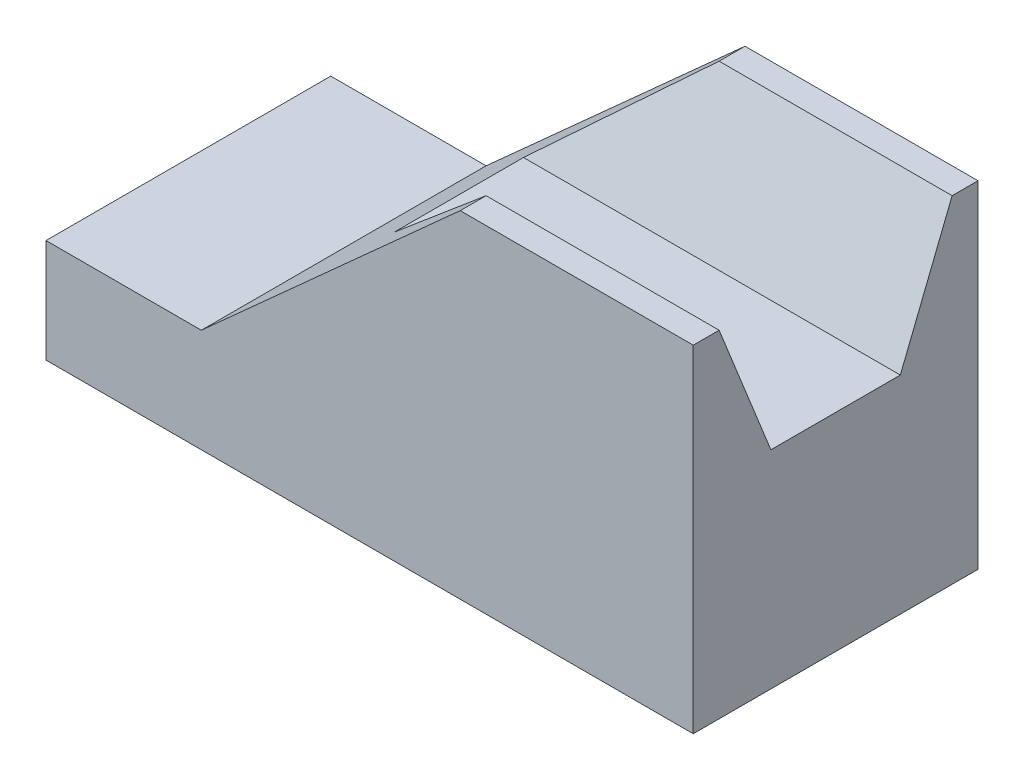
ISO-10303-21;
HEADER;
FILE_DESCRIPTION(('STEP AP214'),'2;1');
FILE_NAME('part.step','',(''),(''),'','','');
FILE_SCHEMA(('AUTOMOTIVE_DESIGN { 1 0 10303 214 1 1 1 1 }'));
ENDSEC;
DATA;
#1=APPLICATION_CONTEXT('core data for automotive mechanical design processes');
#2=APPLICATION_PROTOCOL_DEFINITION('international standard','automotive_design',2000,#1);
#3=PRODUCT_CONTEXT('',#1,'mechanical');
#4=PRODUCT('Part','Part','',(#3));
#5=PRODUCT_RELATED_PRODUCT_CATEGORY('part','',(#4));
#6=PRODUCT_DEFINITION_FORMATION('','',#4);
#7=PRODUCT_DEFINITION_CONTEXT('part definition',#1,'design');
#8=PRODUCT_DEFINITION('design','',#6,#7);
#9=PRODUCT_DEFINITION_SHAPE('','',#8);
#10=(LENGTH_UNIT() NAMED_UNIT(*) SI_UNIT(.MILLI.,.METRE.));
#11=(NAMED_UNIT(*) PLANE_ANGLE_UNIT() SI_UNIT($,.RADIAN.));
#12=(NAMED_UNIT(*) SI_UNIT($,.STERADIAN.) SOLID_ANGLE_UNIT());
#13=UNCERTAINTY_MEASURE_WITH_UNIT(LENGTH_MEASURE(1.E-05),#10,'distance_accuracy_value','');
#14=(GEOMETRIC_REPRESENTATION_CONTEXT(3) GLOBAL_UNCERTAINTY_ASSIGNED_CONTEXT((#13)) GLOBAL_UNIT_ASSIGNED_CONTEXT((#10,
#11,#12)) REPRESENTATION_CONTEXT('',''));
#15=CARTESIAN_POINT('',(0.,0.,0.));
#16=DIRECTION('',(0.,0.,1.));
#17=DIRECTION('',(1.,0.,0.));
#18=AXIS2_PLACEMENT_3D('',#15,#16,#17);
#19=CARTESIAN_POINT('',(50.,26.,11.));
#20=DIRECTION('',(0.,-1.,0.));
#21=DIRECTION('',(1.,0.,0.));
#22=AXIS2_PLACEMENT_3D('',#19,#20,#21);
#23=PLANE('',#22);
#24=DIRECTION('',(0.,0.,-1.));
#25=VECTOR('',#24,1.);
#26=CARTESIAN_POINT('',(32.,26.,11.));
#27=LINE('',#26,#25);
#28=CARTESIAN_POINT('',(32.,26.,-9.));
#29=VERTEX_POINT('',#28);
#30=CARTESIAN_POINT('',(32.,26.,-11.));
#31=VERTEX_POINT('',#30);
#32=EDGE_CURVE('E122',#29,#31,#27,.T.);
#33=ORIENTED_EDGE('',*,*,#32,.F.);
#34=DIRECTION('',(1.,0.,0.));
#35=VECTOR('',#34,1.);
#36=CARTESIAN_POINT('',(0.,26.,-9.));
#37=LINE('',#36,#35);
#38=CARTESIAN_POINT('',(50.,26.,-9.));
#39=VERTEX_POINT('',#38);
#40=EDGE_CURVE('E136',#29,#39,#37,.T.);
#41=ORIENTED_EDGE('',*,*,#40,.T.);
#42=DIRECTION('',(0.,0.,-1.));
#43=VECTOR('',#42,1.);
#44=CARTESIAN_POINT('',(50.,26.,11.));
#45=LINE('',#44,#43);
#46=CARTESIAN_POINT('',(50.,26.,-11.));
#47=VERTEX_POINT('',#46);
#48=EDGE_CURVE('E121',#39,#47,#45,.T.);
#49=ORIENTED_EDGE('',*,*,#48,.T.);
#50=DIRECTION('',(-1.,0.,0.));
#51=VECTOR('',#50,1.);
#52=CARTESIAN_POINT('',(50.,26.,-11.));
#53=LINE('',#52,#51);
#54=EDGE_CURVE('E141',#47,#31,#53,.T.);
#55=ORIENTED_EDGE('',*,*,#54,.T.);
#56=EDGE_LOOP('',(#33,#41,#49,#55));
#57=FACE_BOUND('',#56,.T.);
#58=ADVANCED_FACE('F31',(#57),#23,.F.);
#59=CARTESIAN_POINT('',(0.,8.,11.));
#60=DIRECTION('',(1.,0.,0.));
#61=DIRECTION('',(0.,1.,0.));
#62=AXIS2_PLACEMENT_3D('',#59,#60,#61);
#63=PLANE('',#62);
#64=DIRECTION('',(0.,-1.,0.));
#65=VECTOR('',#64,1.);
#66=CARTESIAN_POINT('',(0.,8.,-11.));
#67=LINE('',#66,#65);
#68=CARTESIAN_POINT('',(0.,8.,-11.));
#69=VERTEX_POINT('',#68);
#70=CARTESIAN_POINT('',(0.,0.,-11.));
#71=VERTEX_POINT('',#70);
#72=EDGE_CURVE('E132',#69,#71,#67,.T.);
#73=ORIENTED_EDGE('',*,*,#72,.T.);
#74=DIRECTION('',(0.,0.,-1.));
#75=VECTOR('',#74,1.);
#76=CARTESIAN_POINT('',(0.,0.,11.));
#77=LINE('',#76,#75);
#78=CARTESIAN_POINT('',(0.,0.,11.));
#79=VERTEX_POINT('',#78);
#80=EDGE_CURVE('E155',#79,#71,#77,.T.);
#81=ORIENTED_EDGE('',*,*,#80,.F.);
#82=DIRECTION('',(0.,-1.,0.));
#83=VECTOR('',#82,1.);
#84=CARTESIAN_POINT('',(0.,8.,11.));
#85=LINE('',#84,#83);
#86=CARTESIAN_POINT('',(0.,8.,11.));
#87=VERTEX_POINT('',#86);
#88=EDGE_CURVE('E147',#87,#79,#85,.T.);
#89=ORIENTED_EDGE('',*,*,#88,.F.);
#90=DIRECTION('',(0.,0.,-1.));
#91=VECTOR('',#90,1.);
#92=CARTESIAN_POINT('',(0.,8.,11.));
#93=LINE('',#92,#91);
#94=EDGE_CURVE('E128',#87,#69,#93,.T.);
#95=ORIENTED_EDGE('',*,*,#94,.T.);
#96=EDGE_LOOP('',(#73,#81,#89,#95));
#97=FACE_BOUND('',#96,.T.);
#98=ADVANCED_FACE('F33',(#97),#63,.F.);
#99=CARTESIAN_POINT('',(0.,0.,11.));
#100=DIRECTION('',(0.,1.,0.));
#101=DIRECTION('',(0.,0.,1.));
#102=AXIS2_PLACEMENT_3D('',#99,#100,#101);
#103=PLANE('',#102);
#104=DIRECTION('',(1.,0.,0.));
#105=VECTOR('',#104,1.);
#106=CARTESIAN_POINT('',(0.,0.,-11.));
#107=LINE('',#106,#105);
#108=CARTESIAN_POINT('',(50.,0.,-11.));
#109=VERTEX_POINT('',#108);
#110=EDGE_CURVE('E135',#71,#109,#107,.T.);
#111=ORIENTED_EDGE('',*,*,#110,.T.);
#112=DIRECTION('',(0.,0.,-1.));
#113=VECTOR('',#112,1.);
#114=CARTESIAN_POINT('',(50.,0.,11.));
#115=LINE('',#114,#113);
#116=CARTESIAN_POINT('',(50.,0.,11.));
#117=VERTEX_POINT('',#116);
#118=EDGE_CURVE('E152',#117,#109,#115,.T.);
#119=ORIENTED_EDGE('',*,*,#118,.F.);
#120=DIRECTION('',(1.,0.,0.));
#121=VECTOR('',#120,1.);
#122=CARTESIAN_POINT('',(0.,0.,11.));
#123=LINE('',#122,#121);
#124=EDGE_CURVE('E91',#79,#117,#123,.T.);
#125=ORIENTED_EDGE('',*,*,#124,.F.);
#126=ORIENTED_EDGE('',*,*,#80,.T.);
#127=EDGE_LOOP('',(#111,#119,#125,#126));
#128=FACE_BOUND('',#127,.T.);
#129=ADVANCED_FACE('F185',(#128),#103,.F.);
#130=CARTESIAN_POINT('',(50.,0.,11.));
#131=DIRECTION('',(-1.,0.,0.));
#132=DIRECTION('',(0.,0.,1.));
#133=AXIS2_PLACEMENT_3D('',#130,#131,#132);
#134=PLANE('',#133);
#135=ORIENTED_EDGE('',*,*,#48,.F.);
#136=DIRECTION('',(0.,0.928476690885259,-0.371390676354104));
#137=VECTOR('',#136,1.);
#138=CARTESIAN_POINT('',(50.,26.,-9.));
#139=LINE('',#138,#137);
#140=CARTESIAN_POINT('',(50.,16.,-5.));
#141=VERTEX_POINT('',#140);
#142=EDGE_CURVE('E181',#141,#39,#139,.T.);
#143=ORIENTED_EDGE('',*,*,#142,.F.);
#144=DIRECTION('',(0.,0.,-1.));
#145=VECTOR('',#144,1.);
#146=CARTESIAN_POINT('',(50.,16.,-5.));
#147=LINE('',#146,#145);
#148=CARTESIAN_POINT('',(50.,16.,5.));
#149=VERTEX_POINT('',#148);
#150=EDGE_CURVE('E170',#149,#141,#147,.T.);
#151=ORIENTED_EDGE('',*,*,#150,.F.);
#152=DIRECTION('',(0.,-0.928476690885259,-0.371390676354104));
#153=VECTOR('',#152,1.);
#154=CARTESIAN_POINT('',(50.,26.,9.));
#155=LINE('',#154,#153);
#156=CARTESIAN_POINT('',(50.,26.,9.));
#157=VERTEX_POINT('',#156);
#158=EDGE_CURVE('E192',#157,#149,#155,.T.);
#159=ORIENTED_EDGE('',*,*,#158,.F.);
#160=CARTESIAN_POINT('',(50.,26.,11.));
#161=VERTEX_POINT('',#160);
#162=EDGE_CURVE('E150',#161,#157,#45,.T.);
#163=ORIENTED_EDGE('',*,*,#162,.F.);
#164=DIRECTION('',(0.,1.,0.));
#165=VECTOR('',#164,1.);
#166=CARTESIAN_POINT('',(50.,0.,11.));
#167=LINE('',#166,#165);
#168=EDGE_CURVE('E107',#117,#161,#167,.T.);
#169=ORIENTED_EDGE('',*,*,#168,.F.);
#170=ORIENTED_EDGE('',*,*,#118,.T.);
#171=DIRECTION('',(0.,1.,0.));
#172=VECTOR('',#171,1.);
#173=CARTESIAN_POINT('',(50.,0.,-11.));
#174=LINE('',#173,#172);
#175=EDGE_CURVE('E138',#109,#47,#174,.T.);
#176=ORIENTED_EDGE('',*,*,#175,.T.);
#177=EDGE_LOOP('',(#135,#143,#151,#159,#163,#169,#170,#176));
#178=FACE_BOUND('',#177,.T.);
#179=ADVANCED_FACE('F189',(#178),#134,.F.);
#180=ORIENTED_EDGE('',*,*,#162,.T.);
#181=DIRECTION('',(1.,0.,0.));
#182=VECTOR('',#181,1.);
#183=CARTESIAN_POINT('',(0.,26.,9.));
#184=LINE('',#183,#182);
#185=CARTESIAN_POINT('',(32.,26.,9.));
#186=VERTEX_POINT('',#185);
#187=EDGE_CURVE('E118',#186,#157,#184,.T.);
#188=ORIENTED_EDGE('',*,*,#187,.F.);
#189=CARTESIAN_POINT('',(32.,26.,11.));
#190=VERTEX_POINT('',#189);
#191=EDGE_CURVE('E114',#190,#186,#27,.T.);
#192=ORIENTED_EDGE('',*,*,#191,.F.);
#193=DIRECTION('',(-1.,0.,0.));
#194=VECTOR('',#193,1.);
#195=CARTESIAN_POINT('',(50.,26.,11.));
#196=LINE('',#195,#194);
#197=EDGE_CURVE('E100',#161,#190,#196,.T.);
#198=ORIENTED_EDGE('',*,*,#197,.F.);
#199=EDGE_LOOP('',(#180,#188,#192,#198));
#200=FACE_BOUND('',#199,.T.);
#201=ADVANCED_FACE('F115',(#200),#23,.F.);
#202=CARTESIAN_POINT('',(32.,26.,11.));
#203=DIRECTION('',(0.66896473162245,-0.743294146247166,0.));
#204=DIRECTION('',(0.743294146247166,0.66896473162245,0.));
#205=AXIS2_PLACEMENT_3D('',#202,#203,#204);
#206=PLANE('',#205);
#207=DIRECTION('',(0.,0.,-1.));
#208=VECTOR('',#207,1.);
#209=CARTESIAN_POINT('',(20.8888888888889,16.,11.));
#210=LINE('',#209,#208);
#211=CARTESIAN_POINT('',(20.8888888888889,16.,5.));
#212=VERTEX_POINT('',#211);
#213=CARTESIAN_POINT('',(20.8888888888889,16.,-5.));
#214=VERTEX_POINT('',#213);
#215=EDGE_CURVE('E39',#212,#214,#210,.T.);
#216=ORIENTED_EDGE('',*,*,#215,.T.);
#217=DIRECTION('',(0.718032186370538,0.646228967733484,-0.258491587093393));
#218=VECTOR('',#217,1.);
#219=CARTESIAN_POINT('',(28.2878944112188,22.6591049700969,-7.66364198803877));
#220=LINE('',#219,#218);
#221=EDGE_CURVE('E11',#214,#29,#220,.T.);
#222=ORIENTED_EDGE('',*,*,#221,.T.);
#223=ORIENTED_EDGE('',*,*,#32,.T.);
#224=DIRECTION('',(-0.743294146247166,-0.66896473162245,0.));
#225=VECTOR('',#224,1.);
#226=CARTESIAN_POINT('',(32.,26.,-11.));
#227=LINE('',#226,#225);
#228=CARTESIAN_POINT('',(12.,8.,-11.));
#229=VERTEX_POINT('',#228);
#230=EDGE_CURVE('E144',#31,#229,#227,.T.);
#231=ORIENTED_EDGE('',*,*,#230,.T.);
#232=DIRECTION('',(0.,0.,-1.));
#233=VECTOR('',#232,1.);
#234=CARTESIAN_POINT('',(12.,8.,11.));
#235=LINE('',#234,#233);
#236=CARTESIAN_POINT('',(12.,8.,11.));
#237=VERTEX_POINT('',#236);
#238=EDGE_CURVE('E126',#237,#229,#235,.T.);
#239=ORIENTED_EDGE('',*,*,#238,.F.);
#240=DIRECTION('',(-0.743294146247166,-0.66896473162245,0.));
#241=VECTOR('',#240,1.);
#242=CARTESIAN_POINT('',(32.,26.,11.));
#243=LINE('',#242,#241);
#244=EDGE_CURVE('E104',#190,#237,#243,.T.);
#245=ORIENTED_EDGE('',*,*,#244,.F.);
#246=ORIENTED_EDGE('',*,*,#191,.T.);
#247=DIRECTION('',(-0.718032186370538,-0.646228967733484,-0.258491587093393));
#248=VECTOR('',#247,1.);
#249=CARTESIAN_POINT('',(32.3712105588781,26.3340895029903,9.13363580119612));
#250=LINE('',#249,#248);
#251=EDGE_CURVE('E157',#186,#212,#250,.T.);
#252=ORIENTED_EDGE('',*,*,#251,.T.);
#253=EDGE_LOOP('',(#216,#222,#223,#231,#239,#245,#246,#252));
#254=FACE_BOUND('',#253,.T.);
#255=ADVANCED_FACE('F125',(#254),#206,.F.);
#256=CARTESIAN_POINT('',(12.,8.,11.));
#257=DIRECTION('',(0.,-1.,0.));
#258=DIRECTION('',(1.,0.,0.));
#259=AXIS2_PLACEMENT_3D('',#256,#257,#258);
#260=PLANE('',#259);
#261=DIRECTION('',(-1.,0.,0.));
#262=VECTOR('',#261,1.);
#263=CARTESIAN_POINT('',(12.,8.,-11.));
#264=LINE('',#263,#262);
#265=EDGE_CURVE('E82',#229,#69,#264,.T.);
#266=ORIENTED_EDGE('',*,*,#265,.T.);
#267=ORIENTED_EDGE('',*,*,#94,.F.);
#268=DIRECTION('',(-1.,0.,0.));
#269=VECTOR('',#268,1.);
#270=CARTESIAN_POINT('',(12.,8.,11.));
#271=LINE('',#270,#269);
#272=EDGE_CURVE('E55',#237,#87,#271,.T.);
#273=ORIENTED_EDGE('',*,*,#272,.F.);
#274=ORIENTED_EDGE('',*,*,#238,.T.);
#275=EDGE_LOOP('',(#266,#267,#273,#274));
#276=FACE_BOUND('',#275,.T.);
#277=ADVANCED_FACE('F222',(#276),#260,.F.);
#278=CARTESIAN_POINT('',(0.,0.,11.));
#279=DIRECTION('',(0.,0.,1.));
#280=DIRECTION('',(1.,0.,0.));
#281=AXIS2_PLACEMENT_3D('',#278,#279,#280);
#282=PLANE('',#281);
#283=ORIENTED_EDGE('',*,*,#88,.T.);
#284=ORIENTED_EDGE('',*,*,#124,.T.);
#285=ORIENTED_EDGE('',*,*,#168,.T.);
#286=ORIENTED_EDGE('',*,*,#197,.T.);
#287=ORIENTED_EDGE('',*,*,#244,.T.);
#288=ORIENTED_EDGE('',*,*,#272,.T.);
#289=EDGE_LOOP('',(#283,#284,#285,#286,#287,#288));
#290=FACE_BOUND('',#289,.T.);
#291=ADVANCED_FACE('F102',(#290),#282,.T.);
#292=CARTESIAN_POINT('',(0.,0.,-11.));
#293=DIRECTION('',(0.,0.,1.));
#294=DIRECTION('',(1.,0.,0.));
#295=AXIS2_PLACEMENT_3D('',#292,#293,#294);
#296=PLANE('',#295);
#297=ORIENTED_EDGE('',*,*,#72,.F.);
#298=ORIENTED_EDGE('',*,*,#265,.F.);
#299=ORIENTED_EDGE('',*,*,#230,.F.);
#300=ORIENTED_EDGE('',*,*,#54,.F.);
#301=ORIENTED_EDGE('',*,*,#175,.F.);
#302=ORIENTED_EDGE('',*,*,#110,.F.);
#303=EDGE_LOOP('',(#297,#298,#299,#300,#301,#302));
#304=FACE_BOUND('',#303,.T.);
#305=ADVANCED_FACE('F265',(#304),#296,.F.);
#306=CARTESIAN_POINT('',(0.,26.,-9.));
#307=DIRECTION('',(0.,-0.371390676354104,-0.928476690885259));
#308=DIRECTION('',(0.,0.92847669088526,-0.371390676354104));
#309=AXIS2_PLACEMENT_3D('',#306,#307,#308);
#310=PLANE('',#309);
#311=DIRECTION('',(1.,0.,0.));
#312=VECTOR('',#311,1.);
#313=CARTESIAN_POINT('',(0.,16.,-5.));
#314=LINE('',#313,#312);
#315=EDGE_CURVE('E167',#214,#141,#314,.T.);
#316=ORIENTED_EDGE('',*,*,#315,.T.);
#317=ORIENTED_EDGE('',*,*,#142,.T.);
#318=ORIENTED_EDGE('',*,*,#40,.F.);
#319=ORIENTED_EDGE('',*,*,#221,.F.);
#320=EDGE_LOOP('',(#316,#317,#318,#319));
#321=FACE_BOUND('',#320,.T.);
#322=ADVANCED_FACE('F205',(#321),#310,.F.);
#323=CARTESIAN_POINT('',(0.,16.,-5.));
#324=DIRECTION('',(0.,-1.,0.));
#325=DIRECTION('',(0.,0.,-1.));
#326=AXIS2_PLACEMENT_3D('',#323,#324,#325);
#327=PLANE('',#326);
#328=DIRECTION('',(1.,0.,0.));
#329=VECTOR('',#328,1.);
#330=CARTESIAN_POINT('',(0.,16.,5.));
#331=LINE('',#330,#329);
#332=EDGE_CURVE('E46',#212,#149,#331,.T.);
#333=ORIENTED_EDGE('',*,*,#332,.T.);
#334=ORIENTED_EDGE('',*,*,#150,.T.);
#335=ORIENTED_EDGE('',*,*,#315,.F.);
#336=ORIENTED_EDGE('',*,*,#215,.F.);
#337=EDGE_LOOP('',(#333,#334,#335,#336));
#338=FACE_BOUND('',#337,.T.);
#339=ADVANCED_FACE('F163',(#338),#327,.F.);
#340=CARTESIAN_POINT('',(0.,26.,9.));
#341=DIRECTION('',(0.,-0.371390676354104,0.928476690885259));
#342=DIRECTION('',(0.,-0.92847669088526,-0.371390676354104));
#343=AXIS2_PLACEMENT_3D('',#340,#341,#342);
#344=PLANE('',#343);
#345=ORIENTED_EDGE('',*,*,#187,.T.);
#346=ORIENTED_EDGE('',*,*,#158,.T.);
#347=ORIENTED_EDGE('',*,*,#332,.F.);
#348=ORIENTED_EDGE('',*,*,#251,.F.);
#349=EDGE_LOOP('',(#345,#346,#347,#348));
#350=FACE_BOUND('',#349,.T.);
#351=ADVANCED_FACE('F199',(#350),#344,.F.);
#352=CLOSED_SHELL('',(#58,#98,#129,#179,#201,#255,#277,#291,#305,#322,#339,#351));
#353=MANIFOLD_SOLID_BREP('B2',#352);
#354=ADVANCED_BREP_SHAPE_REPRESENTATION('',(#18,#353),#14);
#355=SHAPE_DEFINITION_REPRESENTATION(#9,#354);
ENDSEC;
END-ISO-10303-21;
